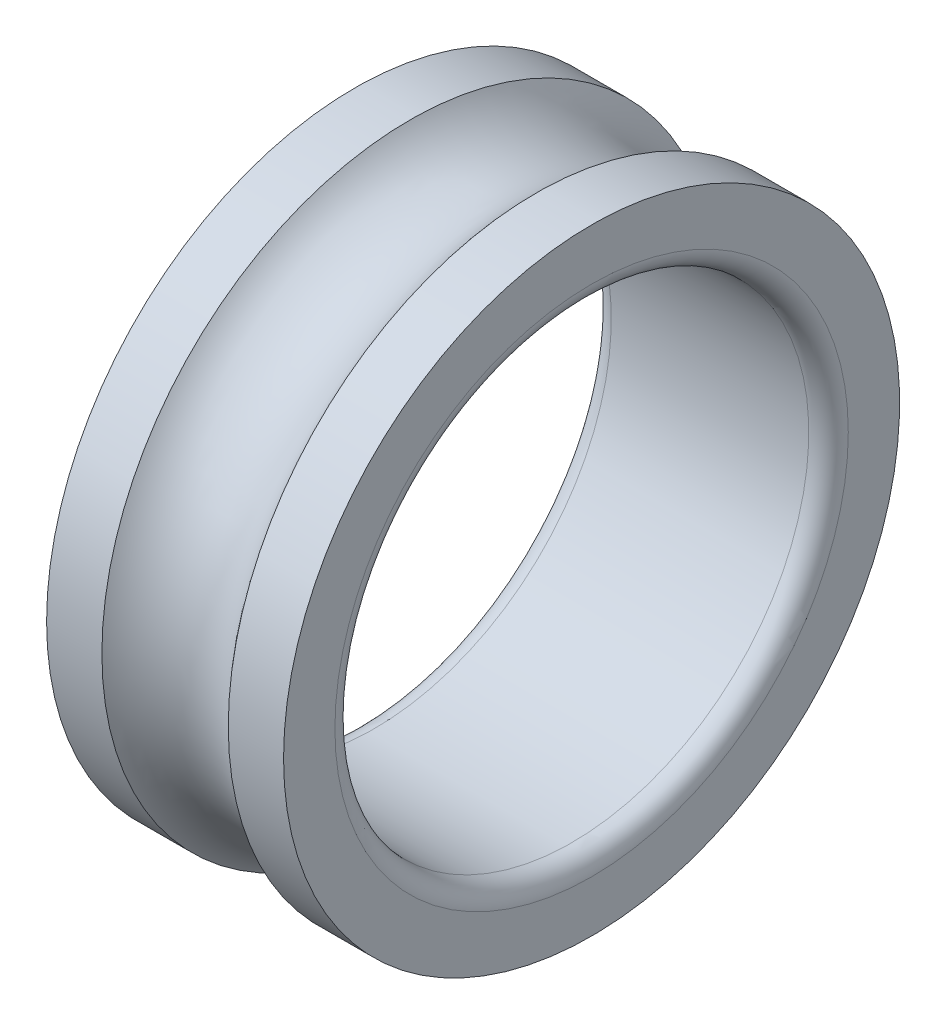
from build123d import *


with BuildPart() as part:
    # Esquisse1 → Base-R_volution (revolve)
    with BuildSketch(Plane.XY, mode=Mode.PRIVATE) as base_r_volution_sk:
        with BuildLine():
            Line((3, 6.5), (3, 7.8))
            Line((3, 7.8), (1.6, 7.8))
            ThreePointArc((1.6, 7.8), (0, 7), (-1.6, 7.8))
            Line((-1.6, 7.8), (-3, 7.8))
            Line((-3, 7.8), (-3, 6.5))
            ThreePointArc((-3, 6.5), (-2.853553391, 6.146446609), (-2.5, 6))
            Line((-2.5, 6), (2.5, 6))
            ThreePointArc((2.5, 6), (2.853553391, 6.146446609), (3, 6.5))
        make_face()
    revolve(base_r_volution_sk.sketch.rotate(Axis((-4.370908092, 0, 0), (1, 0, 0)), 90), axis=Axis((-4.370908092, 0, 0), (1, 0, 0)))


solid = part.part
